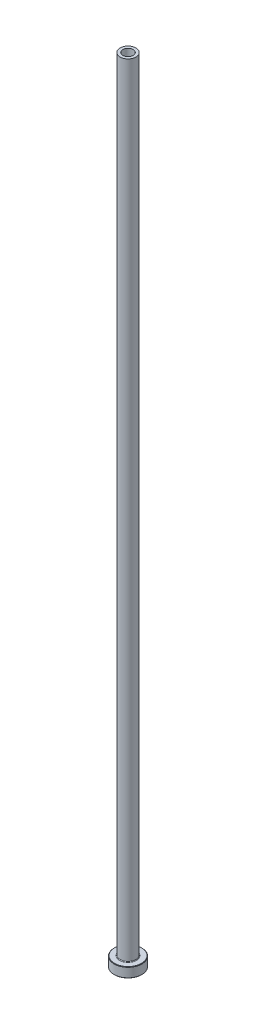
from build123d import *

# Parameters (mm, degrees)
FILLET1_R     = 0.3
CHAMFER1_SIZE = 0.2
CHAMFER3_SIZE = 0.5


with BuildPart() as part:
    # Sketch1 → Revolve1 (revolve)
    with BuildSketch(Plane.XY, mode=Mode.PRIVATE) as revolve1_sk:
        Polygon((-2.6, 400), (-4, 400), (-4, 5), (-7, 5), (-7, 0), (-2.85, 0), (-2.85, 343), (-2.6, 355), align=None)
    revolve(revolve1_sk.sketch.rotate(Axis((0, 92.187680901, 0), (0, -1, 0)), 270), axis=Axis((0, 92.187680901, 0), (0, -1, 0)))

    # Fillet1
    fillet1_edges = [part.edges().sort_by_distance(p)[0] for p in [
        (0, 5, -4),
    ]]
    fillet(fillet1_edges, radius=FILLET1_R)

    # Chamfer1
    chamfer1_edges = [part.edges().sort_by_distance(p)[0] for p in [
        (0, 0, -7),
        (0, 5, -7),
    ]]
    chamfer(chamfer1_edges, length=CHAMFER1_SIZE)

    # Chamfer3
    chamfer3_edges = [part.edges().sort_by_distance(p)[0] for p in [
        (0, 0, -2.85),
    ]]
    chamfer(chamfer3_edges, length=CHAMFER3_SIZE)


solid = part.part
